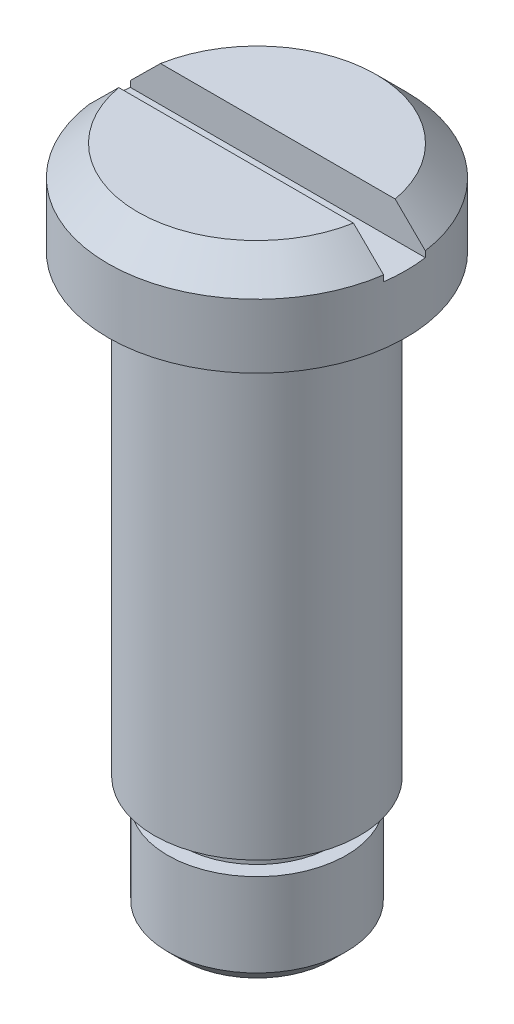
ISO-10303-21;
HEADER;
FILE_DESCRIPTION(('STEP AP214'),'2;1');
FILE_NAME('part.step','',(''),(''),'','','');
FILE_SCHEMA(('AUTOMOTIVE_DESIGN { 1 0 10303 214 1 1 1 1 }'));
ENDSEC;
DATA;
#1=APPLICATION_CONTEXT('core data for automotive mechanical design processes');
#2=APPLICATION_PROTOCOL_DEFINITION('international standard','automotive_design',2000,#1);
#3=PRODUCT_CONTEXT('',#1,'mechanical');
#4=PRODUCT('Part','Part','',(#3));
#5=PRODUCT_RELATED_PRODUCT_CATEGORY('part','',(#4));
#6=PRODUCT_DEFINITION_FORMATION('','',#4);
#7=PRODUCT_DEFINITION_CONTEXT('part definition',#1,'design');
#8=PRODUCT_DEFINITION('design','',#6,#7);
#9=PRODUCT_DEFINITION_SHAPE('','',#8);
#10=(LENGTH_UNIT() NAMED_UNIT(*) SI_UNIT(.MILLI.,.METRE.));
#11=(NAMED_UNIT(*) PLANE_ANGLE_UNIT() SI_UNIT($,.RADIAN.));
#12=(NAMED_UNIT(*) SI_UNIT($,.STERADIAN.) SOLID_ANGLE_UNIT());
#13=UNCERTAINTY_MEASURE_WITH_UNIT(LENGTH_MEASURE(1.E-05),#10,'distance_accuracy_value','');
#14=(GEOMETRIC_REPRESENTATION_CONTEXT(3) GLOBAL_UNCERTAINTY_ASSIGNED_CONTEXT((#13)) GLOBAL_UNIT_ASSIGNED_CONTEXT((#10,
#11,#12)) REPRESENTATION_CONTEXT('',''));
#15=CARTESIAN_POINT('',(0.,0.,0.));
#16=DIRECTION('',(0.,0.,1.));
#17=DIRECTION('',(1.,0.,0.));
#18=AXIS2_PLACEMENT_3D('',#15,#16,#17);
#19=CARTESIAN_POINT('',(0.,22.5,0.));
#20=DIRECTION('',(0.,-1.,0.));
#21=DIRECTION('',(0.,0.,-1.));
#22=AXIS2_PLACEMENT_3D('',#19,#20,#21);
#23=CONICAL_SURFACE('',#22,4.,0.785398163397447);
#24=CARTESIAN_POINT('',(-8.12104975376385,18.3488375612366,0.699999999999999));
#25=CARTESIAN_POINT('',(-7.81217478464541,18.6565592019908,0.699999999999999));
#26=CARTESIAN_POINT('',(-7.50324667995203,18.9642275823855,0.699999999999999));
#27=CARTESIAN_POINT('',(-6.88523419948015,19.5793419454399,0.699999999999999));
#28=CARTESIAN_POINT('',(-6.57614984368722,19.8867879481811,0.699999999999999));
#29=CARTESIAN_POINT('',(-5.95779941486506,20.5013175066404,0.699999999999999));
#30=CARTESIAN_POINT('',(-5.64853342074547,20.8084011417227,0.699999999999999));
#31=CARTESIAN_POINT('',(-5.18428702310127,21.2687063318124,0.699999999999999));
#32=CARTESIAN_POINT('',(-5.02947278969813,21.4220954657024,0.699999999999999));
#33=CARTESIAN_POINT('',(-4.71969593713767,21.7287273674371,0.699999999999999));
#34=CARTESIAN_POINT('',(-4.56473331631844,21.8819701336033,0.699999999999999));
#35=CARTESIAN_POINT('',(-4.2545187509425,22.1883486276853,0.699999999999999));
#36=CARTESIAN_POINT('',(-4.09926668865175,22.3414842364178,0.699999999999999));
#37=CARTESIAN_POINT('',(-3.788496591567,22.6474727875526,0.699999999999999));
#38=CARTESIAN_POINT('',(-3.63297856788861,22.8003257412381,0.699999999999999));
#39=CARTESIAN_POINT('',(-3.32159828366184,23.1055824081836,0.699999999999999));
#40=CARTESIAN_POINT('',(-3.16573614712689,23.2579862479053,0.699999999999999));
#41=CARTESIAN_POINT('',(-2.85339769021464,23.5622101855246,0.699999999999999));
#42=CARTESIAN_POINT('',(-2.69692128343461,23.7140301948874,0.699999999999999));
#43=CARTESIAN_POINT('',(-2.46139219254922,23.9410893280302,0.699999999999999));
#44=CARTESIAN_POINT('',(-2.3827030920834,24.0167054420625,0.699999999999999));
#45=CARTESIAN_POINT('',(-2.22500337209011,24.1675953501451,0.699999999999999));
#46=CARTESIAN_POINT('',(-2.14599276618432,24.242869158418,0.699999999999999));
#47=CARTESIAN_POINT('',(-1.98757119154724,24.3929183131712,0.699999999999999));
#48=CARTESIAN_POINT('',(-1.90816043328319,24.4676938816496,0.699999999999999));
#49=CARTESIAN_POINT('',(-1.74871449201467,24.6166025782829,0.699999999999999));
#50=CARTESIAN_POINT('',(-1.66867921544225,24.690735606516,0.699999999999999));
#51=CARTESIAN_POINT('',(-1.50757805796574,24.8381535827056,0.699999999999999));
#52=CARTESIAN_POINT('',(-1.42651064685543,24.9114368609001,0.699999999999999));
#53=CARTESIAN_POINT('',(-1.26304584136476,25.0564493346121,0.699999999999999));
#54=CARTESIAN_POINT('',(-1.18064902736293,25.1281791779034,0.699999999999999));
#55=CARTESIAN_POINT('',(-1.05528556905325,25.2338518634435,0.699999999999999));
#56=CARTESIAN_POINT('',(-1.01316005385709,25.268789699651,0.699999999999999));
#57=CARTESIAN_POINT('',(-0.928164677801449,25.3377313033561,0.699999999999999));
#58=CARTESIAN_POINT('',(-0.885294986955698,25.3717352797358,0.699999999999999));
#59=CARTESIAN_POINT('',(-0.798479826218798,25.4384935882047,0.699999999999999));
#60=CARTESIAN_POINT('',(-0.754532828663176,25.4712459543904,0.699999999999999));
#61=CARTESIAN_POINT('',(-0.687558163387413,25.5189334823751,0.699999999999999));
#62=CARTESIAN_POINT('',(-0.665048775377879,25.5345948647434,0.699999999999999));
#63=CARTESIAN_POINT('',(-0.619613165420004,25.5653113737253,0.699999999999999));
#64=CARTESIAN_POINT('',(-0.596686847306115,25.5803663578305,0.699999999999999));
#65=CARTESIAN_POINT('',(-0.573521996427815,25.5950538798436,0.699999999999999));
#66=B_SPLINE_CURVE_WITH_KNOTS('',3,(#24,#25,#26,#27,#28,#29,#30,#31,#32,#33,#34,#35,#36,#37,#38,
#39,#40,#41,#42,#43,#44,#45,#46,#47,#48,#49,#50,#51,#52,#53,#54,#55,#56,#57,#58,#59,#60,#61,#62,
#63,#64,#65),.UNSPECIFIED.,.F.,.F.,(4,2,2,2,2,2,2,2,2,2,2,2,2,2,2,2,2,2,2,2,4),(0.,
1.30800128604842,2.61586422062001,3.92334708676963,4.57715207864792,5.23096448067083,
5.88516870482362,6.53934622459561,7.19331746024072,7.84738423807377,8.1747792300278,
8.50216049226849,8.82938455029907,9.15665861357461,9.48449313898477,9.81218821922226,
9.97636426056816,10.1405032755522,10.3048903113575,10.3871467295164,10.4694223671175),.UNSPECIFIED.);
#67=CARTESIAN_POINT('',(-4.95075751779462,21.5,0.699999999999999));
#68=VERTEX_POINT('',#67);
#69=CARTESIAN_POINT('',(-3.93827373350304,22.5,0.699999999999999));
#70=VERTEX_POINT('',#69);
#71=EDGE_CURVE('E184',#68,#70,#66,.T.);
#72=ORIENTED_EDGE('',*,*,#71,.F.);
#73=CARTESIAN_POINT('',(0.,21.5,0.));
#74=DIRECTION('',(0.,1.,0.));
#75=DIRECTION('',(0.,0.,1.));
#76=AXIS2_PLACEMENT_3D('',#73,#74,#75);
#77=CIRCLE('',#76,5.);
#78=CARTESIAN_POINT('',(4.95075751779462,21.5,0.699999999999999));
#79=VERTEX_POINT('',#78);
#80=EDGE_CURVE('E100',#68,#79,#77,.T.);
#81=ORIENTED_EDGE('',*,*,#80,.T.);
#82=CARTESIAN_POINT('',(0.573521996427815,25.5950538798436,0.699999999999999));
#83=CARTESIAN_POINT('',(0.611172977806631,25.5711462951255,0.699999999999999));
#84=CARTESIAN_POINT('',(0.648210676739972,25.546314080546,0.699999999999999));
#85=CARTESIAN_POINT('',(0.72127605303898,25.4952442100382,0.699999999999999));
#86=CARTESIAN_POINT('',(0.757304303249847,25.4690073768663,0.699999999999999));
#87=CARTESIAN_POINT('',(0.828559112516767,25.4155818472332,0.699999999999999));
#88=CARTESIAN_POINT('',(0.863786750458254,25.3883945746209,0.699999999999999));
#89=CARTESIAN_POINT('',(0.933658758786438,25.3332704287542,0.699999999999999));
#90=CARTESIAN_POINT('',(0.96830303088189,25.3053334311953,0.699999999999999));
#91=CARTESIAN_POINT('',(1.07143057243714,25.2207796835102,0.699999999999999));
#92=CARTESIAN_POINT('',(1.13922809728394,25.1633284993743,0.699999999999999));
#93=CARTESIAN_POINT('',(1.27366618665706,25.0470373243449,0.699999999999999));
#94=CARTESIAN_POINT('',(1.34030619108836,24.9881966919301,0.699999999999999));
#95=CARTESIAN_POINT('',(1.4711960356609,24.8710161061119,0.699999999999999));
#96=CARTESIAN_POINT('',(1.53546503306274,24.8126975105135,0.699999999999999));
#97=CARTESIAN_POINT('',(1.66344536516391,24.6954508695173,0.699999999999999));
#98=CARTESIAN_POINT('',(1.72715668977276,24.6365228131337,0.699999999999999));
#99=CARTESIAN_POINT('',(1.91768730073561,24.4590785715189,0.699999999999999));
#100=CARTESIAN_POINT('',(2.04389670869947,24.3399082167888,0.699999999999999));
#101=CARTESIAN_POINT('',(2.29535902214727,24.1005808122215,0.699999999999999));
#102=CARTESIAN_POINT('',(2.42061197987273,23.9804238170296,0.699999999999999));
#103=CARTESIAN_POINT('',(2.67050086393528,23.739478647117,0.699999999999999));
#104=CARTESIAN_POINT('',(2.79513681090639,23.618690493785,0.699999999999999));
#105=CARTESIAN_POINT('',(3.04430844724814,23.3763847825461,0.699999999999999));
#106=CARTESIAN_POINT('',(3.16884309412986,23.2548661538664,0.699999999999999));
#107=CARTESIAN_POINT('',(3.4176182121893,23.0115261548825,0.699999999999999));
#108=CARTESIAN_POINT('',(3.54185868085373,22.8897047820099,0.699999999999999));
#109=CARTESIAN_POINT('',(3.91425092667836,22.5239254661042,0.699999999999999));
#110=CARTESIAN_POINT('',(4.16208347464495,22.279642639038,0.699999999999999));
#111=CARTESIAN_POINT('',(4.72037181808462,21.7282540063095,0.699999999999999));
#112=CARTESIAN_POINT('',(5.0306876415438,21.4210066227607,0.699999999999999));
#113=CARTESIAN_POINT('',(5.65088445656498,20.8060651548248,0.699999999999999));
#114=CARTESIAN_POINT('',(5.9607654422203,20.4983710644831,0.699999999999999));
#115=CARTESIAN_POINT('',(6.57915126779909,19.8838038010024,0.699999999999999));
#116=CARTESIAN_POINT('',(6.88765707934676,19.5769316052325,0.699999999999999));
#117=CARTESIAN_POINT('',(7.50447595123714,18.9630029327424,0.699999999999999));
#118=CARTESIAN_POINT('',(7.81278901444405,18.6559464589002,0.699999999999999));
#119=CARTESIAN_POINT('',(8.12104975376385,18.3488375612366,0.699999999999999));
#120=B_SPLINE_CURVE_WITH_KNOTS('',3,(#82,#83,#84,#85,#86,#87,#88,#89,#90,#91,#92,#93,#94,#95,
#96,#97,#98,#99,#100,#101,#102,#103,#104,#105,#106,#107,#108,#109,#110,#111,#112,#113,#114,#115,
#116,#117,#118,#119),.UNSPECIFIED.,.F.,.F.,(4,2,2,2,2,2,2,2,2,2,2,2,2,2,2,2,2,2,4),(0.,
0.13375493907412,0.267432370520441,0.400917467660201,0.534424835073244,0.800987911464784,
1.06767656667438,1.328024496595,1.58837712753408,2.1091087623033,2.62981174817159,
3.15049720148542,3.67249360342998,4.19449444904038,5.23845452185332,6.54851941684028,
7.85860193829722,9.16402033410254,10.4694188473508),.UNSPECIFIED.);
#121=CARTESIAN_POINT('',(3.93827373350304,22.5,0.699999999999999));
#122=VERTEX_POINT('',#121);
#123=EDGE_CURVE('E187',#122,#79,#120,.T.);
#124=ORIENTED_EDGE('',*,*,#123,.F.);
#125=CARTESIAN_POINT('',(0.,22.5,0.));
#126=DIRECTION('',(0.,1.,0.));
#127=DIRECTION('',(0.,0.,1.));
#128=AXIS2_PLACEMENT_3D('',#125,#126,#127);
#129=CIRCLE('',#128,4.);
#130=EDGE_CURVE('E101',#70,#122,#129,.T.);
#131=ORIENTED_EDGE('',*,*,#130,.F.);
#132=EDGE_LOOP('',(#72,#81,#124,#131));
#133=FACE_BOUND('',#132,.T.);
#134=ADVANCED_FACE('F29',(#133),#23,.T.);
#135=CARTESIAN_POINT('',(-4.,22.5,0.));
#136=DIRECTION('',(0.,1.,0.));
#137=DIRECTION('',(0.,0.,1.));
#138=AXIS2_PLACEMENT_3D('',#135,#136,#137);
#139=PLANE('',#138);
#140=DIRECTION('',(1.,0.,0.));
#141=VECTOR('',#140,1.);
#142=CARTESIAN_POINT('',(-4.,22.5,0.699999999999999));
#143=LINE('',#142,#141);
#144=EDGE_CURVE('E87',#70,#122,#143,.T.);
#145=ORIENTED_EDGE('',*,*,#144,.F.);
#146=ORIENTED_EDGE('',*,*,#130,.T.);
#147=EDGE_LOOP('',(#145,#146));
#148=FACE_BOUND('',#147,.T.);
#149=ADVANCED_FACE('F172',(#148),#139,.T.);
#150=CARTESIAN_POINT('',(0.,0.,0.));
#151=DIRECTION('',(0.,-1.,0.));
#152=DIRECTION('',(0.,0.,-1.));
#153=AXIS2_PLACEMENT_3D('',#150,#151,#152);
#154=PLANE('',#153);
#155=CARTESIAN_POINT('',(0.,0.,0.));
#156=DIRECTION('',(0.,1.,0.));
#157=DIRECTION('',(0.,0.,1.));
#158=AXIS2_PLACEMENT_3D('',#155,#156,#157);
#159=CIRCLE('',#158,2.5);
#160=CARTESIAN_POINT('',(0.,0.,2.5));
#161=VERTEX_POINT('',#160);
#162=EDGE_CURVE('E88',#161,#161,#159,.T.);
#163=ORIENTED_EDGE('',*,*,#162,.F.);
#164=EDGE_LOOP('',(#163));
#165=FACE_BOUND('',#164,.T.);
#166=ADVANCED_FACE('F31',(#165),#154,.T.);
#167=CARTESIAN_POINT('',(0.,0.5,0.));
#168=DIRECTION('',(0.,1.,0.));
#169=DIRECTION('',(0.,0.,1.));
#170=AXIS2_PLACEMENT_3D('',#167,#168,#169);
#171=CONICAL_SURFACE('',#170,3.,0.785398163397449);
#172=ORIENTED_EDGE('',*,*,#162,.T.);
#173=EDGE_LOOP('',(#172));
#174=FACE_BOUND('',#173,.T.);
#175=CARTESIAN_POINT('',(0.,0.5,0.));
#176=DIRECTION('',(0.,1.,0.));
#177=DIRECTION('',(0.,0.,1.));
#178=AXIS2_PLACEMENT_3D('',#175,#176,#177);
#179=CIRCLE('',#178,3.);
#180=CARTESIAN_POINT('',(0.,0.5,3.));
#181=VERTEX_POINT('',#180);
#182=EDGE_CURVE('E127',#181,#181,#179,.T.);
#183=ORIENTED_EDGE('',*,*,#182,.F.);
#184=EDGE_LOOP('',(#183));
#185=FACE_BOUND('',#184,.T.);
#186=ADVANCED_FACE('F205',(#174,#185),#171,.T.);
#187=CARTESIAN_POINT('',(0.,40.,0.));
#188=DIRECTION('',(0.,1.,0.));
#189=DIRECTION('',(0.,0.,1.));
#190=AXIS2_PLACEMENT_3D('',#187,#188,#189);
#191=CYLINDRICAL_SURFACE('',#190,3.);
#192=ORIENTED_EDGE('',*,*,#182,.T.);
#193=EDGE_LOOP('',(#192));
#194=FACE_BOUND('',#193,.T.);
#195=CARTESIAN_POINT('',(0.,3.3,0.));
#196=DIRECTION('',(0.,1.,0.));
#197=DIRECTION('',(0.,0.,1.));
#198=AXIS2_PLACEMENT_3D('',#195,#196,#197);
#199=CIRCLE('',#198,2.99999999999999);
#200=CARTESIAN_POINT('',(0.,3.3,2.99999999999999));
#201=VERTEX_POINT('',#200);
#202=EDGE_CURVE('E124',#201,#201,#199,.T.);
#203=ORIENTED_EDGE('',*,*,#202,.F.);
#204=EDGE_LOOP('',(#203));
#205=FACE_BOUND('',#204,.T.);
#206=ADVANCED_FACE('F212',(#194,#205),#191,.T.);
#207=CARTESIAN_POINT('',(-2.99999999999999,3.3,0.));
#208=DIRECTION('',(0.,1.,0.));
#209=DIRECTION('',(0.,0.,1.));
#210=AXIS2_PLACEMENT_3D('',#207,#208,#209);
#211=PLANE('',#210);
#212=ORIENTED_EDGE('',*,*,#202,.T.);
#213=EDGE_LOOP('',(#212));
#214=FACE_BOUND('',#213,.T.);
#215=CARTESIAN_POINT('',(0.,3.3,0.));
#216=DIRECTION('',(0.,1.,0.));
#217=DIRECTION('',(0.,0.,1.));
#218=AXIS2_PLACEMENT_3D('',#215,#216,#217);
#219=CIRCLE('',#218,2.5);
#220=CARTESIAN_POINT('',(0.,3.3,2.5));
#221=VERTEX_POINT('',#220);
#222=EDGE_CURVE('E121',#221,#221,#219,.T.);
#223=ORIENTED_EDGE('',*,*,#222,.F.);
#224=EDGE_LOOP('',(#223));
#225=FACE_BOUND('',#224,.T.);
#226=ADVANCED_FACE('F219',(#214,#225),#211,.T.);
#227=CARTESIAN_POINT('',(0.,40.,0.));
#228=DIRECTION('',(0.,1.,0.));
#229=DIRECTION('',(0.,0.,1.));
#230=AXIS2_PLACEMENT_3D('',#227,#228,#229);
#231=CYLINDRICAL_SURFACE('',#230,2.5);
#232=ORIENTED_EDGE('',*,*,#222,.T.);
#233=EDGE_LOOP('',(#232));
#234=FACE_BOUND('',#233,.T.);
#235=CARTESIAN_POINT('',(0.,4.1,0.));
#236=DIRECTION('',(0.,1.,0.));
#237=DIRECTION('',(0.,0.,1.));
#238=AXIS2_PLACEMENT_3D('',#235,#236,#237);
#239=CIRCLE('',#238,2.5);
#240=CARTESIAN_POINT('',(0.,4.1,2.5));
#241=VERTEX_POINT('',#240);
#242=EDGE_CURVE('E118',#241,#241,#239,.T.);
#243=ORIENTED_EDGE('',*,*,#242,.F.);
#244=EDGE_LOOP('',(#243));
#245=FACE_BOUND('',#244,.T.);
#246=ADVANCED_FACE('F227',(#234,#245),#231,.T.);
#247=CARTESIAN_POINT('',(-2.5,4.1,0.));
#248=DIRECTION('',(0.,-1.,0.));
#249=DIRECTION('',(0.,0.,-1.));
#250=AXIS2_PLACEMENT_3D('',#247,#248,#249);
#251=PLANE('',#250);
#252=ORIENTED_EDGE('',*,*,#242,.T.);
#253=EDGE_LOOP('',(#252));
#254=FACE_BOUND('',#253,.T.);
#255=CARTESIAN_POINT('',(0.,4.1,0.));
#256=DIRECTION('',(0.,1.,0.));
#257=DIRECTION('',(0.,0.,1.));
#258=AXIS2_PLACEMENT_3D('',#255,#256,#257);
#259=CIRCLE('',#258,3.45);
#260=CARTESIAN_POINT('',(0.,4.1,3.45));
#261=VERTEX_POINT('',#260);
#262=EDGE_CURVE('E115',#261,#261,#259,.T.);
#263=ORIENTED_EDGE('',*,*,#262,.F.);
#264=EDGE_LOOP('',(#263));
#265=FACE_BOUND('',#264,.T.);
#266=ADVANCED_FACE('F235',(#254,#265),#251,.T.);
#267=CARTESIAN_POINT('',(0.,40.,0.));
#268=DIRECTION('',(0.,1.,0.));
#269=DIRECTION('',(0.,0.,1.));
#270=AXIS2_PLACEMENT_3D('',#267,#268,#269);
#271=CYLINDRICAL_SURFACE('',#270,3.45);
#272=ORIENTED_EDGE('',*,*,#262,.T.);
#273=EDGE_LOOP('',(#272));
#274=FACE_BOUND('',#273,.T.);
#275=CARTESIAN_POINT('',(0.,19.35,0.));
#276=DIRECTION('',(0.,1.,0.));
#277=DIRECTION('',(0.,0.,1.));
#278=AXIS2_PLACEMENT_3D('',#275,#276,#277);
#279=CIRCLE('',#278,3.45);
#280=CARTESIAN_POINT('',(0.,19.35,3.45));
#281=VERTEX_POINT('',#280);
#282=EDGE_CURVE('E112',#281,#281,#279,.T.);
#283=ORIENTED_EDGE('',*,*,#282,.F.);
#284=EDGE_LOOP('',(#283));
#285=FACE_BOUND('',#284,.T.);
#286=ADVANCED_FACE('F243',(#274,#285),#271,.T.);
#287=CARTESIAN_POINT('',(-3.45,19.35,0.));
#288=DIRECTION('',(0.,-1.,0.));
#289=DIRECTION('',(0.,0.,-1.));
#290=AXIS2_PLACEMENT_3D('',#287,#288,#289);
#291=PLANE('',#290);
#292=ORIENTED_EDGE('',*,*,#282,.T.);
#293=EDGE_LOOP('',(#292));
#294=FACE_BOUND('',#293,.T.);
#295=CARTESIAN_POINT('',(0.,19.35,0.));
#296=DIRECTION('',(0.,1.,0.));
#297=DIRECTION('',(0.,0.,1.));
#298=AXIS2_PLACEMENT_3D('',#295,#296,#297);
#299=CIRCLE('',#298,5.);
#300=CARTESIAN_POINT('',(0.,19.35,5.));
#301=VERTEX_POINT('',#300);
#302=EDGE_CURVE('E109',#301,#301,#299,.T.);
#303=ORIENTED_EDGE('',*,*,#302,.F.);
#304=EDGE_LOOP('',(#303));
#305=FACE_BOUND('',#304,.T.);
#306=ADVANCED_FACE('F251',(#294,#305),#291,.T.);
#307=CARTESIAN_POINT('',(0.,40.,0.));
#308=DIRECTION('',(0.,1.,0.));
#309=DIRECTION('',(0.,0.,1.));
#310=AXIS2_PLACEMENT_3D('',#307,#308,#309);
#311=CYLINDRICAL_SURFACE('',#310,5.);
#312=DIRECTION('',(0.,1.,0.));
#313=VECTOR('',#312,1.);
#314=CARTESIAN_POINT('',(-4.95075751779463,40.,0.699999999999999));
#315=LINE('',#314,#313);
#316=CARTESIAN_POINT('',(-4.95075751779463,21.3,0.699999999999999));
#317=VERTEX_POINT('',#316);
#318=EDGE_CURVE('E52',#317,#68,#315,.T.);
#319=ORIENTED_EDGE('',*,*,#318,.F.);
#320=CARTESIAN_POINT('',(0.,21.3,0.));
#321=DIRECTION('',(0.,-1.,0.));
#322=DIRECTION('',(0.,0.,-1.));
#323=AXIS2_PLACEMENT_3D('',#320,#321,#322);
#324=CIRCLE('',#323,5.);
#325=CARTESIAN_POINT('',(-4.95075751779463,21.3,-0.699999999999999));
#326=VERTEX_POINT('',#325);
#327=EDGE_CURVE('E11',#326,#317,#324,.F.);
#328=ORIENTED_EDGE('',*,*,#327,.F.);
#329=DIRECTION('',(0.,1.,0.));
#330=VECTOR('',#329,1.);
#331=CARTESIAN_POINT('',(-4.95075751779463,40.,-0.699999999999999));
#332=LINE('',#331,#330);
#333=CARTESIAN_POINT('',(-4.95075751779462,21.5,-0.699999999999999));
#334=VERTEX_POINT('',#333);
#335=EDGE_CURVE('E96',#334,#326,#332,.F.);
#336=ORIENTED_EDGE('',*,*,#335,.F.);
#337=CARTESIAN_POINT('',(4.95075751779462,21.5,-0.699999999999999));
#338=VERTEX_POINT('',#337);
#339=EDGE_CURVE('E95',#338,#334,#77,.T.);
#340=ORIENTED_EDGE('',*,*,#339,.F.);
#341=DIRECTION('',(0.,1.,0.));
#342=VECTOR('',#341,1.);
#343=CARTESIAN_POINT('',(4.95075751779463,40.,-0.699999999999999));
#344=LINE('',#343,#342);
#345=CARTESIAN_POINT('',(4.95075751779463,21.3,-0.699999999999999));
#346=VERTEX_POINT('',#345);
#347=EDGE_CURVE('E97',#346,#338,#344,.T.);
#348=ORIENTED_EDGE('',*,*,#347,.F.);
#349=CARTESIAN_POINT('',(4.95075751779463,21.3,0.699999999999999));
#350=VERTEX_POINT('',#349);
#351=EDGE_CURVE('E33',#350,#346,#324,.F.);
#352=ORIENTED_EDGE('',*,*,#351,.F.);
#353=DIRECTION('',(0.,1.,0.));
#354=VECTOR('',#353,1.);
#355=CARTESIAN_POINT('',(4.95075751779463,40.,0.699999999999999));
#356=LINE('',#355,#354);
#357=EDGE_CURVE('E186',#79,#350,#356,.F.);
#358=ORIENTED_EDGE('',*,*,#357,.F.);
#359=ORIENTED_EDGE('',*,*,#80,.F.);
#360=EDGE_LOOP('',(#319,#328,#336,#340,#348,#352,#358,#359));
#361=FACE_BOUND('',#360,.T.);
#362=ORIENTED_EDGE('',*,*,#302,.T.);
#363=EDGE_LOOP('',(#362));
#364=FACE_BOUND('',#363,.T.);
#365=ADVANCED_FACE('F146',(#361,#364),#311,.T.);
#366=CARTESIAN_POINT('',(-0.573521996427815,25.5950538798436,-0.699999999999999));
#367=CARTESIAN_POINT('',(-0.611172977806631,25.5711462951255,-0.699999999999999));
#368=CARTESIAN_POINT('',(-0.648210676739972,25.546314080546,-0.699999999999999));
#369=CARTESIAN_POINT('',(-0.72127605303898,25.4952442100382,-0.699999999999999));
#370=CARTESIAN_POINT('',(-0.757304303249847,25.4690073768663,-0.699999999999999));
#371=CARTESIAN_POINT('',(-0.828559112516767,25.4155818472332,-0.699999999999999));
#372=CARTESIAN_POINT('',(-0.863786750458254,25.3883945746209,-0.699999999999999));
#373=CARTESIAN_POINT('',(-0.933658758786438,25.3332704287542,-0.699999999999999));
#374=CARTESIAN_POINT('',(-0.96830303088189,25.3053334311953,-0.699999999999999));
#375=CARTESIAN_POINT('',(-1.07143057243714,25.2207796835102,-0.699999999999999));
#376=CARTESIAN_POINT('',(-1.13922809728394,25.1633284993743,-0.699999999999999));
#377=CARTESIAN_POINT('',(-1.27366618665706,25.0470373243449,-0.699999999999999));
#378=CARTESIAN_POINT('',(-1.34030619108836,24.9881966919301,-0.699999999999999));
#379=CARTESIAN_POINT('',(-1.4711960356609,24.8710161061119,-0.699999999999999));
#380=CARTESIAN_POINT('',(-1.53546503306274,24.8126975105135,-0.699999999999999));
#381=CARTESIAN_POINT('',(-1.66344536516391,24.6954508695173,-0.699999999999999));
#382=CARTESIAN_POINT('',(-1.72715668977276,24.6365228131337,-0.699999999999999));
#383=CARTESIAN_POINT('',(-1.91768730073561,24.4590785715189,-0.699999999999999));
#384=CARTESIAN_POINT('',(-2.04389670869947,24.3399082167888,-0.699999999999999));
#385=CARTESIAN_POINT('',(-2.29535902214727,24.1005808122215,-0.699999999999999));
#386=CARTESIAN_POINT('',(-2.42061197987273,23.9804238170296,-0.699999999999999));
#387=CARTESIAN_POINT('',(-2.67050086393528,23.739478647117,-0.699999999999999));
#388=CARTESIAN_POINT('',(-2.79513681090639,23.618690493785,-0.699999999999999));
#389=CARTESIAN_POINT('',(-3.04430844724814,23.3763847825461,-0.699999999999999));
#390=CARTESIAN_POINT('',(-3.16884309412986,23.2548661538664,-0.699999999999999));
#391=CARTESIAN_POINT('',(-3.4176182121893,23.0115261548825,-0.699999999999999));
#392=CARTESIAN_POINT('',(-3.54185868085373,22.8897047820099,-0.699999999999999));
#393=CARTESIAN_POINT('',(-3.91425092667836,22.5239254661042,-0.699999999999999));
#394=CARTESIAN_POINT('',(-4.16208347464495,22.279642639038,-0.699999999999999));
#395=CARTESIAN_POINT('',(-4.72037181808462,21.7282540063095,-0.699999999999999));
#396=CARTESIAN_POINT('',(-5.0306876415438,21.4210066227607,-0.699999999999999));
#397=CARTESIAN_POINT('',(-5.65088445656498,20.8060651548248,-0.699999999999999));
#398=CARTESIAN_POINT('',(-5.9607654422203,20.4983710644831,-0.699999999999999));
#399=CARTESIAN_POINT('',(-6.57915126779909,19.8838038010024,-0.699999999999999));
#400=CARTESIAN_POINT('',(-6.88765707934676,19.5769316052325,-0.699999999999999));
#401=CARTESIAN_POINT('',(-7.50447595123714,18.9630029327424,-0.699999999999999));
#402=CARTESIAN_POINT('',(-7.81278901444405,18.6559464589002,-0.699999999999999));
#403=CARTESIAN_POINT('',(-8.12104975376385,18.3488375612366,-0.699999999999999));
#404=B_SPLINE_CURVE_WITH_KNOTS('',3,(#366,#367,#368,#369,#370,#371,#372,#373,#374,#375,#376,
#377,#378,#379,#380,#381,#382,#383,#384,#385,#386,#387,#388,#389,#390,#391,#392,#393,#394,#395,
#396,#397,#398,#399,#400,#401,#402,#403),.UNSPECIFIED.,.F.,.F.,(4,2,2,2,2,2,2,2,2,2,2,2,2,2,2,2,
2,2,4),(0.,0.13375493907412,0.267432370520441,0.400917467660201,0.534424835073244,
0.800987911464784,1.06767656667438,1.328024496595,1.58837712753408,2.1091087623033,
2.62981174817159,3.15049720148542,3.67249360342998,4.19449444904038,5.23845452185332,
6.54851941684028,7.85860193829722,9.16402033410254,10.4694188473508),.UNSPECIFIED.);
#405=CARTESIAN_POINT('',(-3.93827373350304,22.5,-0.699999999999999));
#406=VERTEX_POINT('',#405);
#407=EDGE_CURVE('E82',#406,#334,#404,.T.);
#408=ORIENTED_EDGE('',*,*,#407,.F.);
#409=CARTESIAN_POINT('',(3.93827373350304,22.5,-0.699999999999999));
#410=VERTEX_POINT('',#409);
#411=EDGE_CURVE('E93',#410,#406,#129,.T.);
#412=ORIENTED_EDGE('',*,*,#411,.F.);
#413=CARTESIAN_POINT('',(8.12104975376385,18.3488375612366,-0.699999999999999));
#414=CARTESIAN_POINT('',(7.81217478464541,18.6565592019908,-0.699999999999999));
#415=CARTESIAN_POINT('',(7.50324667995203,18.9642275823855,-0.699999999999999));
#416=CARTESIAN_POINT('',(6.88523419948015,19.5793419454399,-0.699999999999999));
#417=CARTESIAN_POINT('',(6.57614984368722,19.8867879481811,-0.699999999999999));
#418=CARTESIAN_POINT('',(5.95779941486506,20.5013175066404,-0.699999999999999));
#419=CARTESIAN_POINT('',(5.64853342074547,20.8084011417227,-0.699999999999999));
#420=CARTESIAN_POINT('',(5.18428702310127,21.2687063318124,-0.699999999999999));
#421=CARTESIAN_POINT('',(5.02947278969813,21.4220954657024,-0.699999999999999));
#422=CARTESIAN_POINT('',(4.71969593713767,21.7287273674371,-0.699999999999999));
#423=CARTESIAN_POINT('',(4.56473331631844,21.8819701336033,-0.699999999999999));
#424=CARTESIAN_POINT('',(4.2545187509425,22.1883486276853,-0.699999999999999));
#425=CARTESIAN_POINT('',(4.09926668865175,22.3414842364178,-0.699999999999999));
#426=CARTESIAN_POINT('',(3.788496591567,22.6474727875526,-0.699999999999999));
#427=CARTESIAN_POINT('',(3.63297856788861,22.8003257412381,-0.699999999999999));
#428=CARTESIAN_POINT('',(3.32159828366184,23.1055824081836,-0.699999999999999));
#429=CARTESIAN_POINT('',(3.16573614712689,23.2579862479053,-0.699999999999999));
#430=CARTESIAN_POINT('',(2.85339769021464,23.5622101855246,-0.699999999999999));
#431=CARTESIAN_POINT('',(2.69692128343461,23.7140301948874,-0.699999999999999));
#432=CARTESIAN_POINT('',(2.46139219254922,23.9410893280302,-0.699999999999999));
#433=CARTESIAN_POINT('',(2.3827030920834,24.0167054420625,-0.699999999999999));
#434=CARTESIAN_POINT('',(2.22500337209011,24.1675953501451,-0.699999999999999));
#435=CARTESIAN_POINT('',(2.14599276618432,24.242869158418,-0.699999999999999));
#436=CARTESIAN_POINT('',(1.98757119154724,24.3929183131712,-0.699999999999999));
#437=CARTESIAN_POINT('',(1.90816043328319,24.4676938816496,-0.699999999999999));
#438=CARTESIAN_POINT('',(1.74871449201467,24.6166025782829,-0.699999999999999));
#439=CARTESIAN_POINT('',(1.66867921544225,24.690735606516,-0.699999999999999));
#440=CARTESIAN_POINT('',(1.50757805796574,24.8381535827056,-0.699999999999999));
#441=CARTESIAN_POINT('',(1.42651064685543,24.9114368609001,-0.699999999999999));
#442=CARTESIAN_POINT('',(1.26304584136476,25.0564493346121,-0.699999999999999));
#443=CARTESIAN_POINT('',(1.18064902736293,25.1281791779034,-0.699999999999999));
#444=CARTESIAN_POINT('',(1.05528556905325,25.2338518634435,-0.699999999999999));
#445=CARTESIAN_POINT('',(1.01316005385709,25.268789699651,-0.699999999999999));
#446=CARTESIAN_POINT('',(0.928164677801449,25.3377313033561,-0.699999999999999));
#447=CARTESIAN_POINT('',(0.885294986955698,25.3717352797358,-0.699999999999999));
#448=CARTESIAN_POINT('',(0.798479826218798,25.4384935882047,-0.699999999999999));
#449=CARTESIAN_POINT('',(0.754532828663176,25.4712459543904,-0.699999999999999));
#450=CARTESIAN_POINT('',(0.687558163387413,25.5189334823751,-0.699999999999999));
#451=CARTESIAN_POINT('',(0.665048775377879,25.5345948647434,-0.699999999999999));
#452=CARTESIAN_POINT('',(0.619613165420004,25.5653113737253,-0.699999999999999));
#453=CARTESIAN_POINT('',(0.596686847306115,25.5803663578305,-0.699999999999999));
#454=CARTESIAN_POINT('',(0.573521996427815,25.5950538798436,-0.699999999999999));
#455=B_SPLINE_CURVE_WITH_KNOTS('',3,(#413,#414,#415,#416,#417,#418,#419,#420,#421,#422,#423,
#424,#425,#426,#427,#428,#429,#430,#431,#432,#433,#434,#435,#436,#437,#438,#439,#440,#441,#442,
#443,#444,#445,#446,#447,#448,#449,#450,#451,#452,#453,#454),.UNSPECIFIED.,.F.,.F.,(4,2,2,2,2,2,
2,2,2,2,2,2,2,2,2,2,2,2,2,2,4),(0.,1.30800128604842,2.61586422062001,3.92334708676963,
4.57715207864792,5.23096448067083,5.88516870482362,6.53934622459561,7.19331746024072,
7.84738423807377,8.1747792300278,8.50216049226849,8.82938455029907,9.15665861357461,
9.48449313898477,9.81218821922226,9.97636426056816,10.1405032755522,10.3048903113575,
10.3871467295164,10.4694223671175),.UNSPECIFIED.);
#456=EDGE_CURVE('E44',#338,#410,#455,.T.);
#457=ORIENTED_EDGE('',*,*,#456,.F.);
#458=ORIENTED_EDGE('',*,*,#339,.T.);
#459=EDGE_LOOP('',(#408,#412,#457,#458));
#460=FACE_BOUND('',#459,.T.);
#461=ADVANCED_FACE('F92',(#460),#23,.T.);
#462=DIRECTION('',(-1.,0.,0.));
#463=VECTOR('',#462,1.);
#464=CARTESIAN_POINT('',(-4.,22.5,-0.699999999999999));
#465=LINE('',#464,#463);
#466=EDGE_CURVE('E79',#410,#406,#465,.T.);
#467=ORIENTED_EDGE('',*,*,#466,.F.);
#468=ORIENTED_EDGE('',*,*,#411,.T.);
#469=EDGE_LOOP('',(#467,#468));
#470=FACE_BOUND('',#469,.T.);
#471=ADVANCED_FACE('F99',(#470),#139,.T.);
#472=CARTESIAN_POINT('',(7.5,21.3,0.699999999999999));
#473=DIRECTION('',(0.,0.,1.));
#474=DIRECTION('',(1.,0.,0.));
#475=AXIS2_PLACEMENT_3D('',#472,#473,#474);
#476=PLANE('',#475);
#477=ORIENTED_EDGE('',*,*,#318,.T.);
#478=ORIENTED_EDGE('',*,*,#71,.T.);
#479=ORIENTED_EDGE('',*,*,#144,.T.);
#480=ORIENTED_EDGE('',*,*,#123,.T.);
#481=ORIENTED_EDGE('',*,*,#357,.T.);
#482=DIRECTION('',(1.,0.,0.));
#483=VECTOR('',#482,1.);
#484=CARTESIAN_POINT('',(7.5,21.3,0.699999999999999));
#485=LINE('',#484,#483);
#486=EDGE_CURVE('E141',#317,#350,#485,.T.);
#487=ORIENTED_EDGE('',*,*,#486,.F.);
#488=EDGE_LOOP('',(#477,#478,#479,#480,#481,#487));
#489=FACE_BOUND('',#488,.T.);
#490=ADVANCED_FACE('F167',(#489),#476,.F.);
#491=CARTESIAN_POINT('',(7.5,21.3,-0.699999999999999));
#492=DIRECTION('',(0.,0.,-1.));
#493=DIRECTION('',(-1.,0.,0.));
#494=AXIS2_PLACEMENT_3D('',#491,#492,#493);
#495=PLANE('',#494);
#496=ORIENTED_EDGE('',*,*,#335,.T.);
#497=DIRECTION('',(-1.,0.,0.));
#498=VECTOR('',#497,1.);
#499=CARTESIAN_POINT('',(7.5,21.3,-0.699999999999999));
#500=LINE('',#499,#498);
#501=EDGE_CURVE('E139',#346,#326,#500,.T.);
#502=ORIENTED_EDGE('',*,*,#501,.F.);
#503=ORIENTED_EDGE('',*,*,#347,.T.);
#504=ORIENTED_EDGE('',*,*,#456,.T.);
#505=ORIENTED_EDGE('',*,*,#466,.T.);
#506=ORIENTED_EDGE('',*,*,#407,.T.);
#507=EDGE_LOOP('',(#496,#502,#503,#504,#505,#506));
#508=FACE_BOUND('',#507,.T.);
#509=ADVANCED_FACE('F81',(#508),#495,.F.);
#510=CARTESIAN_POINT('',(7.5,21.3,0.699999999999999));
#511=DIRECTION('',(0.,-1.,0.));
#512=DIRECTION('',(0.,0.,-1.));
#513=AXIS2_PLACEMENT_3D('',#510,#511,#512);
#514=PLANE('',#513);
#515=ORIENTED_EDGE('',*,*,#327,.T.);
#516=ORIENTED_EDGE('',*,*,#486,.T.);
#517=ORIENTED_EDGE('',*,*,#351,.T.);
#518=ORIENTED_EDGE('',*,*,#501,.T.);
#519=EDGE_LOOP('',(#515,#516,#517,#518));
#520=FACE_BOUND('',#519,.T.);
#521=ADVANCED_FACE('F138',(#520),#514,.F.);
#522=CLOSED_SHELL('',(#134,#149,#166,#186,#206,#226,#246,#266,#286,#306,#365,#461,#471,#490,
#509,#521));
#523=MANIFOLD_SOLID_BREP('B2',#522);
#524=ADVANCED_BREP_SHAPE_REPRESENTATION('',(#18,#523),#14);
#525=SHAPE_DEFINITION_REPRESENTATION(#9,#524);
ENDSEC;
END-ISO-10303-21;
